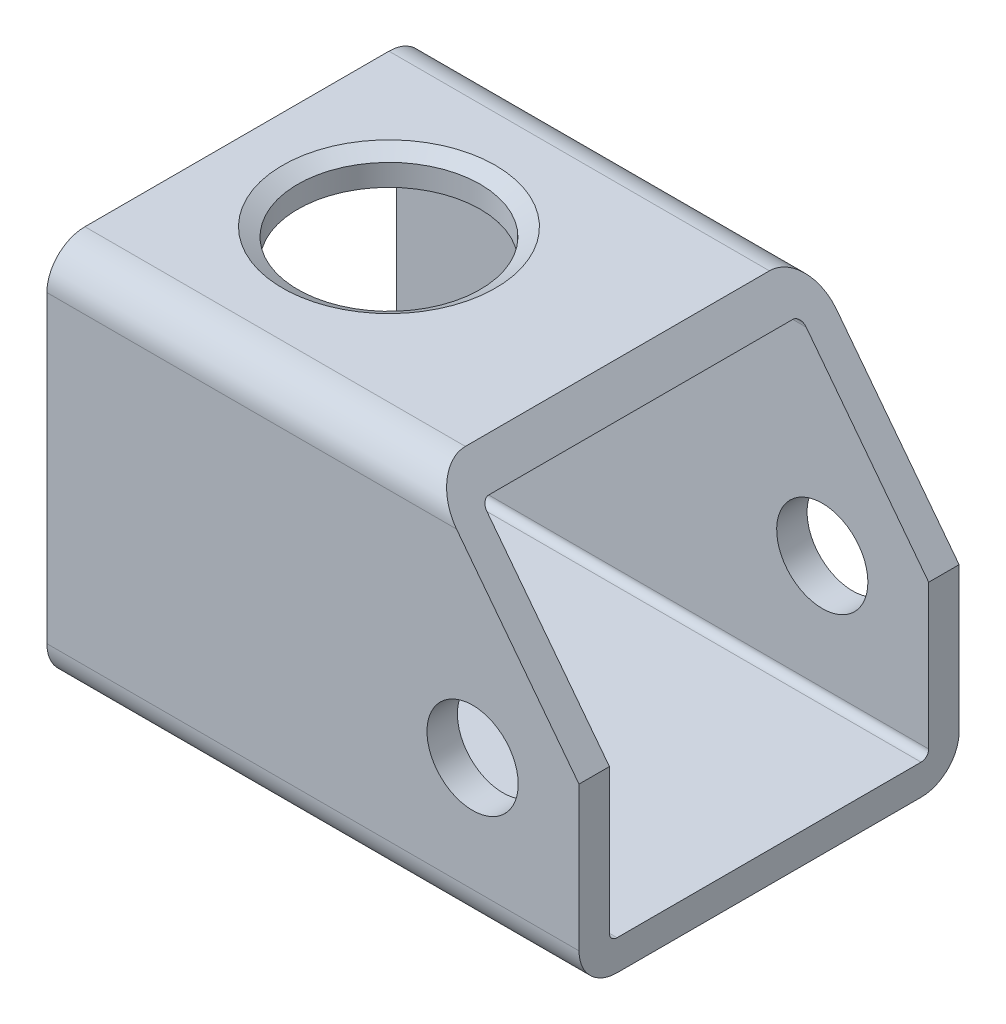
from build123d import *

# Parameters (mm, degrees)
BOSS_EXTRU_1_DEPTH           = 35
ENL_V_MAT_EXTRU_1_DEPTH      = 45.791182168
ENL_V_MAT_EXTRU_1_DEPTH_BACK = 45.791182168
ESQUISSE3_R                  = 3
ENL_V_MAT_EXTRU_2_DEPTH      = 45.791182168
ENL_V_MAT_EXTRU_3_REACH      = 46.791
ESQUISSE4_R                  = 6
CHANFREIN1_SIZE              = 1
CHANFREIN1_SIZE2             = 0.577350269


with BuildPart() as part:
    # Esquisse1 → Boss.-Extru.1 (new body)
    with BuildSketch(Plane(origin=(0, 0, 0), x_dir=(0, 0, -1), z_dir=(1, 0, 0))):
        with BuildLine():
            Line((-10, 12.5), (10, 12.5))
            ThreePointArc((10, 12.5), (11.767766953, 11.767766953), (12.5, 10))
            Line((12.5, 10), (12.5, -10))
            ThreePointArc((12.5, -10), (11.767766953, -11.767766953), (10, -12.5))
            Line((10, -12.5), (-10, -12.5))
            ThreePointArc((-10, -12.5), (-11.767766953, -11.767766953), (-12.5, -10))
            Line((-12.5, -10), (-12.5, 10))
            ThreePointArc((-12.5, 10), (-11.767766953, 11.767766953), (-10, 12.5))
        make_face()
        with BuildLine():
            Line((-10.5, 10), (-10.5, -10))
            ThreePointArc((-10.5, -10), (-10.353553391, -10.353553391), (-10, -10.5))
            Line((-10, -10.5), (10, -10.5))
            ThreePointArc((10, -10.5), (10.353553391, -10.353553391), (10.5, -10))
            Line((10.5, -10), (10.5, 10))
            ThreePointArc((10.5, 10), (10.353553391, 10.353553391), (10, 10.5))
            Line((10, 10.5), (-10, 10.5))
            ThreePointArc((-10, 10.5), (-10.353553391, 10.353553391), (-10.5, 10))
        make_face(mode=Mode.SUBTRACT)
    extrude(amount=BOSS_EXTRU_1_DEPTH)

    # Esquisse2 → Enl_v. mat.-Extru.1 (cut, two sides: drawn at the far end of the back side and taken through both)
    with BuildSketch(Plane.XY.offset(12.5).offset(-ENL_V_MAT_EXTRU_1_DEPTH_BACK)):
        Polygon((-26.520675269, 79.675304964), (25.024749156, 12.5), (35, -0.5), (86.545424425, -67.675304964), (220.896034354, 35.415543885), (107.82993466, 182.766153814), align=None)
    extrude(amount=ENL_V_MAT_EXTRU_1_DEPTH + ENL_V_MAT_EXTRU_1_DEPTH_BACK, mode=Mode.SUBTRACT)

    # Esquisse3 → Enl_v. mat.-Extru.2 (cut, through all)
    with BuildSketch(Plane.XY.offset(12.5)):
        with Locations((28, -2.5)):
            Circle(ESQUISSE3_R)
    extrude(amount=-ENL_V_MAT_EXTRU_2_DEPTH, mode=Mode.SUBTRACT)

    # Esquisse4 → Enl_v. mat.-Extru.3 (cut, up to next)
    with BuildSketch(Plane(origin=(0, 12.5, 0), x_dir=(1, 0, 0), z_dir=(0, 1, 0)), mode=Mode.PRIVATE) as enl_v_mat_extru_3_sk1:
        with Locations(Location((10, 0, 0), (0, 0, 270))):
            Circle(ESQUISSE4_R)
    enl_v_mat_extru_3_tool1 = extrude(enl_v_mat_extru_3_sk1.sketch, amount=-ENL_V_MAT_EXTRU_3_REACH, mode=Mode.PRIVATE) & part.part
    add(enl_v_mat_extru_3_tool1.solids().sort_by_distance((10, 12.5, 0))[0], mode=Mode.SUBTRACT)

    # Chanfrein1
    chanfrein1_edges = [part.edges().sort_by_distance(p)[0] for p in [
        (10, 12.5, -6),
    ]]
    chanfrein1_side = [part.faces().sort_by_distance(p)[0] for p in [
        (0.320349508, 12.5, 0),
    ]]
    chamfer(chanfrein1_edges, length=CHANFREIN1_SIZE, length2=CHANFREIN1_SIZE2, reference=chanfrein1_side[0])


solid = part.part
